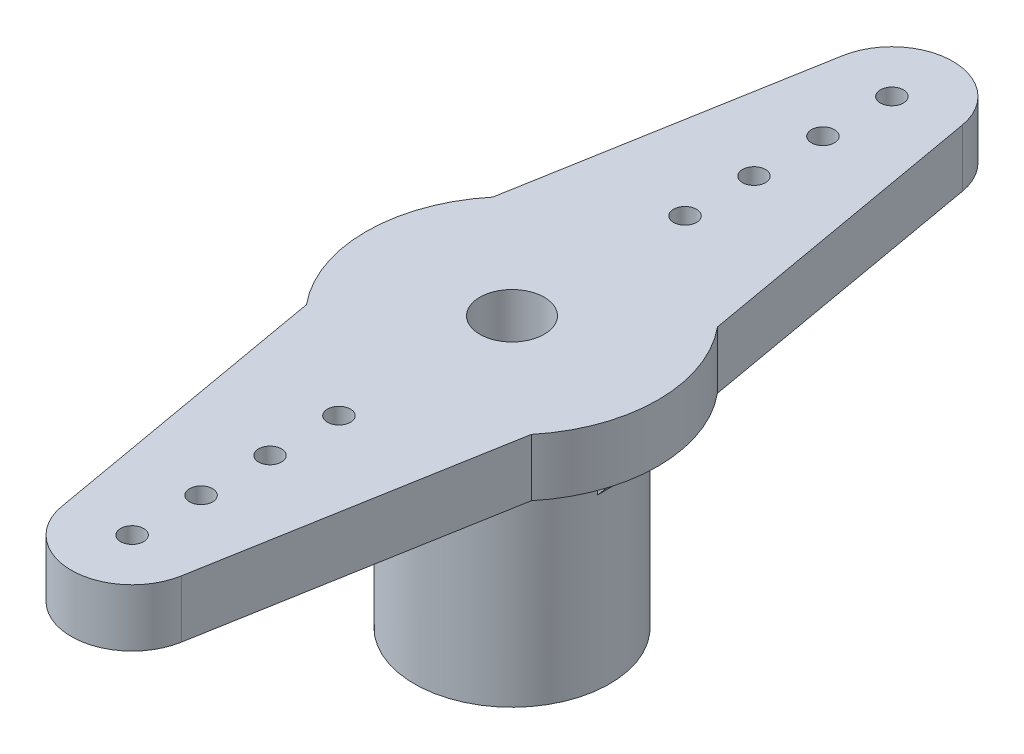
from build123d import *

# Parameters (mm, degrees)
SKETCH1_R               = 6.35
BOSS_EXTRUDE1_DEPTH     = 11.75
HORN_START              = -2.5
HORN_DEPTH              = 2.5
SKETCH4_R               = 1.4
CUT_EXTRUDE1_DEPTH      = 24.372150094
SKETCH5_R               = 0.5
CUT_EXTRUDE2_DEPTH      = 24.372150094
LPATTERN1_COUNT         = 4
LPATTERN1_PITCH         = 3
MIRROR1_COPY_1_SKETCH_R = 0.5
MIRROR1_COPY_1_DEPTH    = 24.372150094
MIRROR1_COPY_2_SKETCH_R = 0.5
MIRROR1_COPY_2_DEPTH    = 24.372150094
MIRROR1_COPY_3_SKETCH_R = 0.5
MIRROR1_COPY_3_DEPTH    = 24.372150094
CUT_EXTRUDE4_DEPTH      = 3
CIRPATTERN2_COUNT       = 26
SKETCH9_R               = 2.6
CUT_EXTRUDE5_DEPTH      = 3
SKETCH10_R              = 6.35
SKETCH10_R_2            = 4.25
CUT_EXTRUDE6_DEPTH      = 9.25
BOSS_EXTRUDE5_DEPTH     = 0.5
CIRPATTERN3_COUNT       = 4


with BuildPart() as part:
    # Sketch1 → Boss-Extrude1 (new body)
    with BuildSketch(Plane(origin=(0, 0, 0), x_dir=(1, 0, 0), z_dir=(0, 1, 0))):
        with Locations(Location((0, 0, 0), (0, 0, 270))):
            Circle(SKETCH1_R)
    extrude(amount=BOSS_EXTRUDE1_DEPTH)

    # Sketch2 → horn (add)
    with BuildSketch(Plane(origin=(0, 11.75, 0), x_dir=(1, 0, 0), z_dir=(0, 1, 0)).offset(HORN_START)):
        with BuildLine():
            Line((-2.609740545, 16.990167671), (-4.891612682, 4.049027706))
            ThreePointArc((-4.891612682, 4.049027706), (0, 6.35), (4.891612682, 4.049027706))
            Line((4.891612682, 4.049027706), (2.609740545, 16.990167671))
            ThreePointArc((2.609740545, 16.990167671), (0, 19.18), (-2.609740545, 16.990167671))
        make_face()
    horn = extrude(amount=HORN_DEPTH)

    # Sketch4 → Cut-Extrude1 (cut, through all)
    with BuildSketch(Plane(origin=(0, 11.75, 0), x_dir=(-1, 0, 0), z_dir=(0, -1, 0))):
        with Locations(Location((0, 0, 0), (0, 0, 90))):
            Circle(SKETCH4_R)
    extrude(amount=CUT_EXTRUDE1_DEPTH, mode=Mode.SUBTRACT)

    # Sketch5 → Cut-Extrude2 (cut, through all)
    with BuildSketch(Plane(origin=(0, 0, 0), x_dir=(-1, 0, 0), z_dir=(0, -1, 0))):
        with Locations(Location((0, 16.53, 0), (0, 0, 90))):
            Circle(SKETCH5_R)
    cut_extrude2 = extrude(amount=-CUT_EXTRUDE2_DEPTH, mode=Mode.SUBTRACT)

    # LPattern1: Cut-Extrude2 ×4
    with Locations(*[(0, 0, i * LPATTERN1_PITCH) for i in range(1, LPATTERN1_COUNT)]):
        add(cut_extrude2, mode=Mode.SUBTRACT)

    # Mirror1: horn, Cut-Extrude2 across plane
    add(horn.mirror(Plane.XY))
    add(cut_extrude2.mirror(Plane.XY), mode=Mode.SUBTRACT)

    # Mirror1 copy 1 sketch → Mirror1 copy 1 (cut, through all)
    with BuildSketch(Plane(origin=(0, 0, -3), x_dir=(-1, 0, 0), z_dir=(0, -1, 0))):
        with Locations((0, -16.53)):
            Circle(MIRROR1_COPY_1_SKETCH_R)
    extrude(amount=-MIRROR1_COPY_1_DEPTH, mode=Mode.SUBTRACT)

    # Mirror1 copy 2 sketch → Mirror1 copy 2 (cut, through all)
    with BuildSketch(Plane(origin=(0, 0, -6), x_dir=(-1, 0, 0), z_dir=(0, -1, 0))):
        with Locations((0, -16.53)):
            Circle(MIRROR1_COPY_2_SKETCH_R)
    extrude(amount=-MIRROR1_COPY_2_DEPTH, mode=Mode.SUBTRACT)

    # Mirror1 copy 3 sketch → Mirror1 copy 3 (cut, through all)
    with BuildSketch(Plane(origin=(0, 0, -9), x_dir=(-1, 0, 0), z_dir=(0, -1, 0))):
        with Locations((0, -16.53)):
            Circle(MIRROR1_COPY_3_SKETCH_R)
    extrude(amount=-MIRROR1_COPY_3_DEPTH, mode=Mode.SUBTRACT)

    # Sketch8 → Cut-Extrude4 (cut)
    with BuildSketch(Plane(origin=(0, 0, 0), x_dir=(-1, 0, 0), z_dir=(0, -1, 0))):
        with BuildLine():
            Line((0, -2.9), (0.262912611, -2.586672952))
            ThreePointArc((0.262912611, -2.586672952), (0, -2.6), (-0.262912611, -2.586672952))
            Line((-0.262912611, -2.586672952), (0, -2.9))
        make_face()
    cut_extrude4 = extrude(amount=-CUT_EXTRUDE4_DEPTH, mode=Mode.SUBTRACT)

    # CirPattern2: Cut-Extrude4 ×26 about axis
    cirpattern2_axis = Axis((0, 0, 0), (0, 1, 0))
    for i in range(1, CIRPATTERN2_COUNT):
        add(cut_extrude4.rotate(cirpattern2_axis, i * 360 / CIRPATTERN2_COUNT), mode=Mode.SUBTRACT)

    # Sketch9 → Cut-Extrude5 (cut)
    with BuildSketch(Plane(origin=(0, 0, 0), x_dir=(-1, 0, 0), z_dir=(0, -1, 0))):
        Circle(SKETCH9_R)
    extrude(amount=-CUT_EXTRUDE5_DEPTH, mode=Mode.SUBTRACT)

    # Sketch10 → Cut-Extrude6 (cut)
    with BuildSketch(Plane(origin=(0, 0, 0), x_dir=(-1, 0, 0), z_dir=(0, -1, 0))):
        Circle(SKETCH10_R)
        with Locations(Location((0, 0, 0), (0, 0, 90))):
            Circle(SKETCH10_R_2, mode=Mode.SUBTRACT)
    extrude(amount=-CUT_EXTRUDE6_DEPTH, mode=Mode.SUBTRACT)

    # Sketch11 → Boss-Extrude5 (add, symmetric)
    with BuildSketch(Plane.XY):
        Polygon((4.21, 7.34), (5.812680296, 9.25), (4.21, 9.25), (4.16, 9.25), (4.16, 7.34), align=None)
    boss_extrude5 = extrude(amount=BOSS_EXTRUDE5_DEPTH, both=True)

    # CirPattern3: Boss-Extrude5 ×4 about axis
    cirpattern3_axis = Axis((0, 0, 0), (0, 1, 0))
    for i in range(1, CIRPATTERN3_COUNT):
        add(boss_extrude5.rotate(cirpattern3_axis, i * 360 / CIRPATTERN3_COUNT))


solid = part.part
